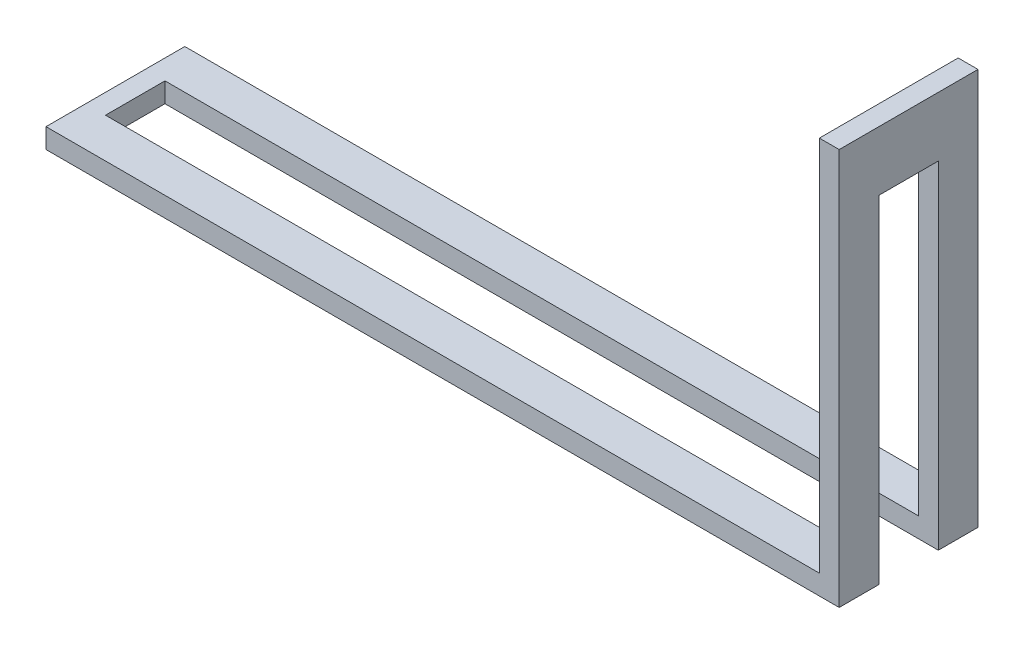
from build123d import *

# Parameters (mm, degrees)
BOSS_EXTRU_1_DEPTH      = 14
ESQUISSE2_W             = 78
ESQUISSE2_H             = 6
ENL_V_MAT_EXTRU_1_DEPTH = 34


with BuildPart() as part:
    # Esquisse1 → Boss.-Extru.1 (new body)
    with BuildSketch(Plane.XY):
        Polygon((0, 0), (80, 0), (80, 40), (78, 40), (78, 2), (0, 2), align=None)
    extrude(amount=BOSS_EXTRU_1_DEPTH)

    # Esquisse2 → Enl_v. mat.-Extru.1 (cut)
    with BuildSketch(Plane.XZ):
        with Locations((41, 7)):
            Rectangle(ESQUISSE2_W, ESQUISSE2_H)
    extrude(amount=-ENL_V_MAT_EXTRU_1_DEPTH, mode=Mode.SUBTRACT)


solid = part.part
